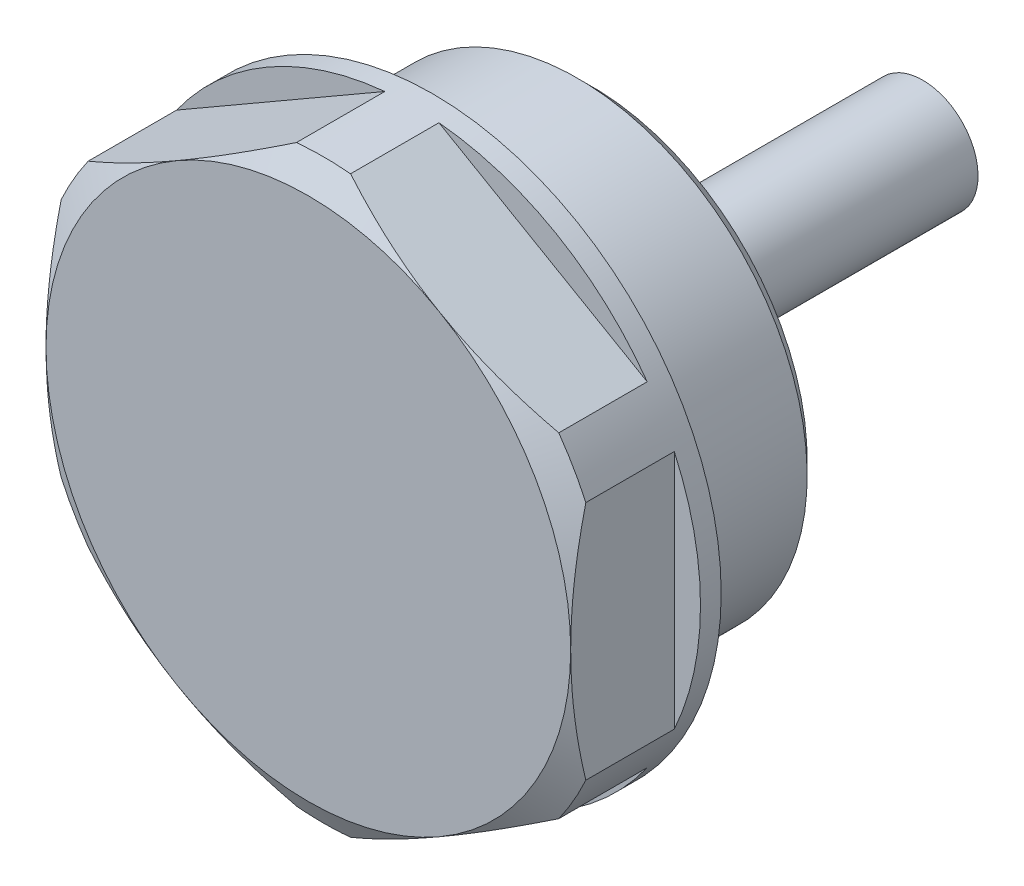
ISO-10303-21;
HEADER;
FILE_DESCRIPTION(('STEP AP214'),'2;1');
FILE_NAME('part.step','',(''),(''),'','','');
FILE_SCHEMA(('AUTOMOTIVE_DESIGN { 1 0 10303 214 1 1 1 1 }'));
ENDSEC;
DATA;
#1=APPLICATION_CONTEXT('core data for automotive mechanical design processes');
#2=APPLICATION_PROTOCOL_DEFINITION('international standard','automotive_design',2000,#1);
#3=PRODUCT_CONTEXT('',#1,'mechanical');
#4=PRODUCT('Part','Part','',(#3));
#5=PRODUCT_RELATED_PRODUCT_CATEGORY('part','',(#4));
#6=PRODUCT_DEFINITION_FORMATION('','',#4);
#7=PRODUCT_DEFINITION_CONTEXT('part definition',#1,'design');
#8=PRODUCT_DEFINITION('design','',#6,#7);
#9=PRODUCT_DEFINITION_SHAPE('','',#8);
#10=(LENGTH_UNIT() NAMED_UNIT(*) SI_UNIT(.MILLI.,.METRE.));
#11=(NAMED_UNIT(*) PLANE_ANGLE_UNIT() SI_UNIT($,.RADIAN.));
#12=(NAMED_UNIT(*) SI_UNIT($,.STERADIAN.) SOLID_ANGLE_UNIT());
#13=UNCERTAINTY_MEASURE_WITH_UNIT(LENGTH_MEASURE(1.E-05),#10,'distance_accuracy_value','');
#14=(GEOMETRIC_REPRESENTATION_CONTEXT(3) GLOBAL_UNCERTAINTY_ASSIGNED_CONTEXT((#13)) GLOBAL_UNIT_ASSIGNED_CONTEXT((#10,
#11,#12)) REPRESENTATION_CONTEXT('',''));
#15=CARTESIAN_POINT('',(0.,0.,0.));
#16=DIRECTION('',(0.,0.,1.));
#17=DIRECTION('',(1.,0.,0.));
#18=AXIS2_PLACEMENT_3D('',#15,#16,#17);
#19=CARTESIAN_POINT('',(0.,0.,9.5));
#20=DIRECTION('',(0.,0.,-1.));
#21=DIRECTION('',(0.,-1.,0.));
#22=AXIS2_PLACEMENT_3D('',#19,#20,#21);
#23=CONICAL_SURFACE('',#22,19.,1.0471975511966);
#24=CARTESIAN_POINT('',(0.,0.,8.40303448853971));
#25=DIRECTION('',(0.,0.,-1.));
#26=DIRECTION('',(0.,-1.,0.));
#27=AXIS2_PLACEMENT_3D('',#24,#25,#26);
#28=CIRCLE('',#27,20.9);
#29=CARTESIAN_POINT('',(-1.9596087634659,20.8079295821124,8.40303448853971));
#30=VERTEX_POINT('',#29);
#31=CARTESIAN_POINT('',(1.95960876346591,20.8079295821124,8.40303448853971));
#32=VERTEX_POINT('',#31);
#33=EDGE_CURVE('E188',#30,#32,#28,.T.);
#34=ORIENTED_EDGE('',*,*,#33,.F.);
#35=CARTESIAN_POINT('',(-1.9588886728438,20.8083453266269,8.40283448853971));
#36=CARTESIAN_POINT('',(-2.36142183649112,20.5759426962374,8.51465084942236));
#37=CARTESIAN_POINT('',(-2.76546131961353,20.3426703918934,8.61946734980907));
#38=CARTESIAN_POINT('',(-3.57644812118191,19.8744469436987,8.81355760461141));
#39=CARTESIAN_POINT('',(-3.98339626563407,19.639495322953,8.90282674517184));
#40=CARTESIAN_POINT('',(-4.80032360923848,19.1678421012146,9.06430340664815));
#41=CARTESIAN_POINT('',(-5.21030574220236,18.931138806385,9.1364913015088));
#42=CARTESIAN_POINT('',(-6.03237944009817,18.4565143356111,9.26222903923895));
#43=CARTESIAN_POINT('',(-6.44447079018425,18.2185932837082,9.31578074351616));
#44=CARTESIAN_POINT('',(-7.26217182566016,17.7464933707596,9.40222271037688));
#45=CARTESIAN_POINT('',(-7.66775095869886,17.512332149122,9.43549598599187));
#46=CARTESIAN_POINT('',(-8.47978498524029,17.0435040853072,9.4822434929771));
#47=CARTESIAN_POINT('',(-8.8862399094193,16.808837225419,9.49571701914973));
#48=CARTESIAN_POINT('',(-9.69896691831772,16.3396090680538,9.50254033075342));
#49=CARTESIAN_POINT('',(-10.1052389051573,16.1050478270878,9.49590549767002));
#50=CARTESIAN_POINT('',(-10.9171362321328,15.6362986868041,9.46270611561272));
#51=CARTESIAN_POINT('',(-11.3227616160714,15.402110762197,9.43614297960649));
#52=CARTESIAN_POINT('',(-12.1730086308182,14.9112204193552,9.36009347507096));
#53=CARTESIAN_POINT('',(-12.6174948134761,14.6545962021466,9.30858931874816));
#54=CARTESIAN_POINT('',(-13.504161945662,14.1426786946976,9.18356820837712));
#55=CARTESIAN_POINT('',(-13.9463426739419,13.8873855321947,9.11004917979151));
#56=CARTESIAN_POINT('',(-14.8326825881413,13.3756569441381,8.94181360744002));
#57=CARTESIAN_POINT('',(-15.2768092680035,13.1192402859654,8.84687086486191));
#58=CARTESIAN_POINT('',(-16.1615947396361,12.6084091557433,8.63833387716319));
#59=CARTESIAN_POINT('',(-16.6022548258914,12.3539939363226,8.52474697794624));
#60=CARTESIAN_POINT('',(-17.0411113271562,12.1006200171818,8.40283448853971));
#61=B_SPLINE_CURVE_WITH_KNOTS('',3,(#35,#36,#37,#38,#39,#40,#41,#42,#43,#44,#45,#46,#47,#48,#49,
#50,#51,#52,#53,#54,#55,#56,#57,#58,#59,#60),.UNSPECIFIED.,.F.,.F.,(4,2,2,2,2,2,2,2,2,2,2,2,4),
(0.,1.43422321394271,2.86887132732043,4.30515990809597,5.74130498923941,7.14940828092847,
8.55756172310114,9.96463829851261,11.3716151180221,12.9185787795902,14.4656882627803,
16.0299678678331,17.5936326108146),.UNSPECIFIED.);
#62=CARTESIAN_POINT('',(-9.5,16.4544826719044,9.5));
#63=VERTEX_POINT('',#62);
#64=EDGE_CURVE('E291',#30,#63,#61,.T.);
#65=ORIENTED_EDGE('',*,*,#64,.T.);
#66=CARTESIAN_POINT('',(0.,0.,9.5));
#67=DIRECTION('',(0.,0.,-1.));
#68=DIRECTION('',(0.,-1.,0.));
#69=AXIS2_PLACEMENT_3D('',#66,#67,#68);
#70=CIRCLE('',#69,19.);
#71=CARTESIAN_POINT('',(9.5,16.4544826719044,9.5));
#72=VERTEX_POINT('',#71);
#73=EDGE_CURVE('E170',#63,#72,#70,.T.);
#74=ORIENTED_EDGE('',*,*,#73,.T.);
#75=CARTESIAN_POINT('',(17.0411113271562,12.1006200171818,8.40283448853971));
#76=CARTESIAN_POINT('',(16.6385781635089,12.3330226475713,8.51465084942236));
#77=CARTESIAN_POINT('',(16.2345386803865,12.5662949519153,8.61946734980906));
#78=CARTESIAN_POINT('',(15.4235518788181,13.03451840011,8.8135576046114));
#79=CARTESIAN_POINT('',(15.0166037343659,13.2694700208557,8.90282674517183));
#80=CARTESIAN_POINT('',(14.1996763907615,13.7411232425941,9.06430340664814));
#81=CARTESIAN_POINT('',(13.7896942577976,13.9778265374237,9.13649130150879));
#82=CARTESIAN_POINT('',(12.9676205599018,14.4524510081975,9.26222903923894));
#83=CARTESIAN_POINT('',(12.5555292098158,14.6903720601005,9.31578074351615));
#84=CARTESIAN_POINT('',(11.7378281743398,15.1624719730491,9.40222271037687));
#85=CARTESIAN_POINT('',(11.3322490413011,15.3966331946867,9.43549598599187));
#86=CARTESIAN_POINT('',(10.5202150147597,15.8654612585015,9.4822434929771));
#87=CARTESIAN_POINT('',(10.1137600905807,16.1001281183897,9.49571701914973));
#88=CARTESIAN_POINT('',(9.30103308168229,16.5693562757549,9.50254033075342));
#89=CARTESIAN_POINT('',(8.89476109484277,16.8039175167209,9.49590549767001));
#90=CARTESIAN_POINT('',(8.0828637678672,17.2726666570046,9.46270611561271));
#91=CARTESIAN_POINT('',(7.67723838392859,17.5068545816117,9.43614297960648));
#92=CARTESIAN_POINT('',(6.82699136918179,17.9977449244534,9.36009347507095));
#93=CARTESIAN_POINT('',(6.38250518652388,18.254369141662,9.30858931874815));
#94=CARTESIAN_POINT('',(5.49583805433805,18.7662866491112,9.18356820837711));
#95=CARTESIAN_POINT('',(5.0536573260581,19.021579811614,9.1100491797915));
#96=CARTESIAN_POINT('',(4.16731741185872,19.5333083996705,8.94181360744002));
#97=CARTESIAN_POINT('',(3.72319073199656,19.7897250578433,8.8468708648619));
#98=CARTESIAN_POINT('',(2.83840526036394,20.3005561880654,8.63833387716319));
#99=CARTESIAN_POINT('',(2.39774517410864,20.554971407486,8.52474697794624));
#100=CARTESIAN_POINT('',(1.9588886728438,20.8083453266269,8.40283448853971));
#101=B_SPLINE_CURVE_WITH_KNOTS('',3,(#75,#76,#77,#78,#79,#80,#81,#82,#83,#84,#85,#86,#87,#88,
#89,#90,#91,#92,#93,#94,#95,#96,#97,#98,#99,#100),.UNSPECIFIED.,.F.,.F.,(4,2,2,2,2,2,2,2,2,2,2,
2,4),(0.,1.43422321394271,2.86887132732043,4.30515990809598,5.74130498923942,7.14940828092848,
8.55756172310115,9.96463829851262,11.3716151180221,12.9185787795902,14.4656882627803,
16.0299678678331,17.5936326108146),.UNSPECIFIED.);
#102=EDGE_CURVE('E193',#72,#32,#101,.T.);
#103=ORIENTED_EDGE('',*,*,#102,.T.);
#104=EDGE_LOOP('',(#34,#65,#74,#103));
#105=FACE_BOUND('',#104,.T.);
#106=ADVANCED_FACE('F14',(#105),#23,.T.);
#107=CARTESIAN_POINT('',(-9.5,-16.4544826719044,9.5));
#108=VERTEX_POINT('',#107);
#109=CARTESIAN_POINT('',(-19.,0.,9.5));
#110=VERTEX_POINT('',#109);
#111=EDGE_CURVE('E171',#108,#110,#70,.T.);
#112=ORIENTED_EDGE('',*,*,#111,.T.);
#113=CARTESIAN_POINT('',(-19.,-29.0099972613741,0.448167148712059));
#114=CARTESIAN_POINT('',(-19.,-28.5932310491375,0.649453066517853));
#115=CARTESIAN_POINT('',(-19.,-28.1759587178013,0.849690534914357));
#116=CARTESIAN_POINT('',(-19.,-27.3402948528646,1.24782772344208));
#117=CARTESIAN_POINT('',(-19.,-26.9219033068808,1.44572741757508));
#118=CARTESIAN_POINT('',(-19.,-25.664765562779,2.03561651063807));
#119=CARTESIAN_POINT('',(-19.,-24.8241931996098,2.4237295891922));
#120=CARTESIAN_POINT('',(-19.,-23.1323589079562,3.18933506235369));
#121=CARTESIAN_POINT('',(-19.,-22.281063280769,3.56675317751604));
#122=CARTESIAN_POINT('',(-19.,-20.5714451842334,4.30526464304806));
#123=CARTESIAN_POINT('',(-19.,-19.7131230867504,4.66635885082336));
#124=CARTESIAN_POINT('',(-19.,-17.9778201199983,5.37199593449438));
#125=CARTESIAN_POINT('',(-19.,-17.1007386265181,5.71629265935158));
#126=CARTESIAN_POINT('',(-19.,-15.3361947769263,6.37771380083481));
#127=CARTESIAN_POINT('',(-19.,-14.4487312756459,6.69483518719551));
#128=CARTESIAN_POINT('',(-19.,-12.663891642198,7.29331972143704));
#129=CARTESIAN_POINT('',(-19.,-11.7665414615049,7.57475962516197));
#130=CARTESIAN_POINT('',(-19.,-9.95900117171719,8.09270063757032));
#131=CARTESIAN_POINT('',(-19.,-9.04881524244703,8.32921602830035));
#132=CARTESIAN_POINT('',(-19.,-7.67373068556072,8.64160120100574));
#133=CARTESIAN_POINT('',(-19.,-7.21361889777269,8.73868386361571));
#134=CARTESIAN_POINT('',(-19.,-6.29034994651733,8.91717605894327));
#135=CARTESIAN_POINT('',(-19.,-5.82719285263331,8.99858594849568));
#136=CARTESIAN_POINT('',(-19.,-4.89815023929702,9.14428461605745));
#137=CARTESIAN_POINT('',(-19.,-4.43226455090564,9.20857232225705));
#138=CARTESIAN_POINT('',(-19.,-3.49830525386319,9.31873266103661));
#139=CARTESIAN_POINT('',(-19.,-3.03023164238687,9.36460526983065));
#140=CARTESIAN_POINT('',(-19.,-2.095502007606,9.43670492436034));
#141=CARTESIAN_POINT('',(-19.,-1.62885536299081,9.46305276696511));
#142=CARTESIAN_POINT('',(-19.,-0.694867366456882,9.49596562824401));
#143=CARTESIAN_POINT('',(-19.,-0.227526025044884,9.50253094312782));
#144=CARTESIAN_POINT('',(-19.,0.706885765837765,9.4957235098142));
#145=CARTESIAN_POINT('',(-19.,1.17395625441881,9.48235618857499));
#146=CARTESIAN_POINT('',(-19.,2.10712670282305,9.43601320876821));
#147=CARTESIAN_POINT('',(-19.,2.57322661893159,9.40303668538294));
#148=CARTESIAN_POINT('',(-19.,3.70524434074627,9.29981799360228));
#149=CARTESIAN_POINT('',(-19.,4.37026916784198,9.21962144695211));
#150=CARTESIAN_POINT('',(-19.,5.69508745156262,9.02379044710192));
#151=CARTESIAN_POINT('',(-19.,6.35488010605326,8.90815066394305));
#152=CARTESIAN_POINT('',(-19.,7.66958790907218,8.64536829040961));
#153=CARTESIAN_POINT('',(-19.,8.324489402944,8.49815802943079));
#154=CARTESIAN_POINT('',(-19.,9.62756096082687,8.1768017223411));
#155=CARTESIAN_POINT('',(-19.,10.2757312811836,8.00265670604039));
#156=CARTESIAN_POINT('',(-19.,11.5804886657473,7.62727333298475));
#157=CARTESIAN_POINT('',(-19.,12.2369203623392,7.4254985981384));
#158=CARTESIAN_POINT('',(-19.,13.5433530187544,7.00203754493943));
#159=CARTESIAN_POINT('',(-19.,14.1933533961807,6.78034944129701));
#160=CARTESIAN_POINT('',(-19.,15.483794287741,6.32173698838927));
#161=CARTESIAN_POINT('',(-19.,16.1242680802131,6.08490591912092));
#162=CARTESIAN_POINT('',(-19.,17.0809502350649,5.7194934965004));
#163=CARTESIAN_POINT('',(-19.,17.399122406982,5.59601556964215));
#164=CARTESIAN_POINT('',(-19.,18.0342314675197,5.34594718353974));
#165=CARTESIAN_POINT('',(-19.,18.3511683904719,5.21935681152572));
#166=CARTESIAN_POINT('',(-19.,18.6675329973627,5.0913501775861));
#167=B_SPLINE_CURVE_WITH_KNOTS('',3,(#113,#114,#115,#116,#117,#118,#119,#120,#121,#122,#123,
#124,#125,#126,#127,#128,#129,#130,#131,#132,#133,#134,#135,#136,#137,#138,#139,#140,#141,#142,
#143,#144,#145,#146,#147,#148,#149,#150,#151,#152,#153,#154,#155,#156,#157,#158,#159,#160,#161,
#162,#163,#164,#165,#166),.UNSPECIFIED.,.F.,.F.,(4,2,2,2,2,2,2,2,2,2,2,2,2,2,2,2,2,2,2,2,2,2,2,
2,2,2,4),(0.,1.38848236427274,2.77698015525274,5.55443218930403,8.34792422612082,
11.1412693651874,13.9676390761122,16.794323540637,19.6148203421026,22.4344189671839,
23.8449221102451,25.2553931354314,26.6659524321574,28.0765135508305,29.478273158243,
30.8800117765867,32.2813688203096,33.6827876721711,35.6911962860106,37.6999070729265,
39.7129673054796,41.7259505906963,43.785798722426,45.8458317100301,47.8942117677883,
48.9180750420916,49.9419096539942),.UNSPECIFIED.);
#168=CARTESIAN_POINT('',(-19.,-8.7068938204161,8.40303448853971));
#169=VERTEX_POINT('',#168);
#170=EDGE_CURVE('E278',#110,#169,#167,.F.);
#171=ORIENTED_EDGE('',*,*,#170,.T.);
#172=CARTESIAN_POINT('',(-17.0403912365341,-12.1010357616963,8.40303448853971));
#173=VERTEX_POINT('',#172);
#174=EDGE_CURVE('E347',#173,#169,#28,.T.);
#175=ORIENTED_EDGE('',*,*,#174,.F.);
#176=CARTESIAN_POINT('',(-17.0411113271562,-12.1006200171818,8.40283448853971));
#177=CARTESIAN_POINT('',(-16.6385781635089,-12.3330226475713,8.51465084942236));
#178=CARTESIAN_POINT('',(-16.2345386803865,-12.5662949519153,8.61946734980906));
#179=CARTESIAN_POINT('',(-15.4235518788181,-13.03451840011,8.8135576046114));
#180=CARTESIAN_POINT('',(-15.0166037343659,-13.2694700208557,8.90282674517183));
#181=CARTESIAN_POINT('',(-14.1996763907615,-13.7411232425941,9.06430340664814));
#182=CARTESIAN_POINT('',(-13.7896942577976,-13.9778265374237,9.13649130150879));
#183=CARTESIAN_POINT('',(-12.9676205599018,-14.4524510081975,9.26222903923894));
#184=CARTESIAN_POINT('',(-12.5555292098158,-14.6903720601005,9.31578074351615));
#185=CARTESIAN_POINT('',(-11.7378281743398,-15.1624719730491,9.40222271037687));
#186=CARTESIAN_POINT('',(-11.3322490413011,-15.3966331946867,9.43549598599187));
#187=CARTESIAN_POINT('',(-10.5202150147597,-15.8654612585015,9.4822434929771));
#188=CARTESIAN_POINT('',(-10.1137600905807,-16.1001281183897,9.49571701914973));
#189=CARTESIAN_POINT('',(-9.30103308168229,-16.5693562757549,9.50254033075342));
#190=CARTESIAN_POINT('',(-8.89476109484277,-16.8039175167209,9.49590549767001));
#191=CARTESIAN_POINT('',(-8.0828637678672,-17.2726666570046,9.46270611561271));
#192=CARTESIAN_POINT('',(-7.67723838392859,-17.5068545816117,9.43614297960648));
#193=CARTESIAN_POINT('',(-6.82699136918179,-17.9977449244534,9.36009347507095));
#194=CARTESIAN_POINT('',(-6.38250518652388,-18.254369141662,9.30858931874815));
#195=CARTESIAN_POINT('',(-5.49583805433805,-18.7662866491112,9.18356820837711));
#196=CARTESIAN_POINT('',(-5.0536573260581,-19.021579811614,9.1100491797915));
#197=CARTESIAN_POINT('',(-4.16731741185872,-19.5333083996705,8.94181360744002));
#198=CARTESIAN_POINT('',(-3.72319073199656,-19.7897250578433,8.8468708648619));
#199=CARTESIAN_POINT('',(-2.83840526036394,-20.3005561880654,8.63833387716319));
#200=CARTESIAN_POINT('',(-2.39774517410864,-20.554971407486,8.52474697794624));
#201=CARTESIAN_POINT('',(-1.9588886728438,-20.8083453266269,8.40283448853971));
#202=B_SPLINE_CURVE_WITH_KNOTS('',3,(#176,#177,#178,#179,#180,#181,#182,#183,#184,#185,#186,
#187,#188,#189,#190,#191,#192,#193,#194,#195,#196,#197,#198,#199,#200,#201),.UNSPECIFIED.,.F.,
.F.,(4,2,2,2,2,2,2,2,2,2,2,2,4),(0.,1.43422321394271,2.86887132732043,4.30515990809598,
5.74130498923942,7.14940828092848,8.55756172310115,9.96463829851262,11.3716151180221,
12.9185787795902,14.4656882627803,16.0299678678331,17.5936326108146),.UNSPECIFIED.);
#203=EDGE_CURVE('E279',#173,#108,#202,.T.);
#204=ORIENTED_EDGE('',*,*,#203,.T.);
#205=EDGE_LOOP('',(#112,#171,#175,#204));
#206=FACE_BOUND('',#205,.T.);
#207=ADVANCED_FACE('F262',(#206),#23,.T.);
#208=CARTESIAN_POINT('',(9.5,-16.4544826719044,9.5));
#209=VERTEX_POINT('',#208);
#210=EDGE_CURVE('E283',#209,#108,#70,.T.);
#211=ORIENTED_EDGE('',*,*,#210,.T.);
#212=CARTESIAN_POINT('',(-1.95960876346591,-20.8079295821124,8.40303448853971));
#213=VERTEX_POINT('',#212);
#214=EDGE_CURVE('E289',#108,#213,#202,.T.);
#215=ORIENTED_EDGE('',*,*,#214,.T.);
#216=CARTESIAN_POINT('',(1.9596087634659,-20.8079295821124,8.40303448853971));
#217=VERTEX_POINT('',#216);
#218=EDGE_CURVE('E346',#217,#213,#28,.T.);
#219=ORIENTED_EDGE('',*,*,#218,.F.);
#220=CARTESIAN_POINT('',(1.9588886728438,-20.8083453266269,8.40283448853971));
#221=CARTESIAN_POINT('',(2.36142183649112,-20.5759426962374,8.51465084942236));
#222=CARTESIAN_POINT('',(2.76546131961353,-20.3426703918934,8.61946734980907));
#223=CARTESIAN_POINT('',(3.57644812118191,-19.8744469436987,8.81355760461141));
#224=CARTESIAN_POINT('',(3.98339626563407,-19.639495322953,8.90282674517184));
#225=CARTESIAN_POINT('',(4.80032360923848,-19.1678421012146,9.06430340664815));
#226=CARTESIAN_POINT('',(5.21030574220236,-18.931138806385,9.1364913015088));
#227=CARTESIAN_POINT('',(6.03237944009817,-18.4565143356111,9.26222903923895));
#228=CARTESIAN_POINT('',(6.44447079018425,-18.2185932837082,9.31578074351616));
#229=CARTESIAN_POINT('',(7.26217182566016,-17.7464933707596,9.40222271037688));
#230=CARTESIAN_POINT('',(7.66775095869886,-17.512332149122,9.43549598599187));
#231=CARTESIAN_POINT('',(8.47978498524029,-17.0435040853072,9.4822434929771));
#232=CARTESIAN_POINT('',(8.8862399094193,-16.808837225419,9.49571701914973));
#233=CARTESIAN_POINT('',(9.69896691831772,-16.3396090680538,9.50254033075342));
#234=CARTESIAN_POINT('',(10.1052389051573,-16.1050478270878,9.49590549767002));
#235=CARTESIAN_POINT('',(10.9171362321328,-15.6362986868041,9.46270611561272));
#236=CARTESIAN_POINT('',(11.3227616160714,-15.402110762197,9.43614297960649));
#237=CARTESIAN_POINT('',(12.1730086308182,-14.9112204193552,9.36009347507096));
#238=CARTESIAN_POINT('',(12.6174948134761,-14.6545962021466,9.30858931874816));
#239=CARTESIAN_POINT('',(13.504161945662,-14.1426786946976,9.18356820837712));
#240=CARTESIAN_POINT('',(13.9463426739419,-13.8873855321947,9.11004917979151));
#241=CARTESIAN_POINT('',(14.8326825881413,-13.3756569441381,8.94181360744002));
#242=CARTESIAN_POINT('',(15.2768092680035,-13.1192402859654,8.84687086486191));
#243=CARTESIAN_POINT('',(16.1615947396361,-12.6084091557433,8.63833387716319));
#244=CARTESIAN_POINT('',(16.6022548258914,-12.3539939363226,8.52474697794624));
#245=CARTESIAN_POINT('',(17.0411113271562,-12.1006200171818,8.40283448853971));
#246=B_SPLINE_CURVE_WITH_KNOTS('',3,(#220,#221,#222,#223,#224,#225,#226,#227,#228,#229,#230,
#231,#232,#233,#234,#235,#236,#237,#238,#239,#240,#241,#242,#243,#244,#245),.UNSPECIFIED.,.F.,
.F.,(4,2,2,2,2,2,2,2,2,2,2,2,4),(0.,1.43422321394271,2.86887132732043,4.30515990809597,
5.74130498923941,7.14940828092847,8.55756172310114,9.96463829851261,11.3716151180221,
12.9185787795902,14.4656882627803,16.0299678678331,17.5936326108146),.UNSPECIFIED.);
#247=EDGE_CURVE('E327',#217,#209,#246,.T.);
#248=ORIENTED_EDGE('',*,*,#247,.T.);
#249=EDGE_LOOP('',(#211,#215,#219,#248));
#250=FACE_BOUND('',#249,.T.);
#251=ADVANCED_FACE('F266',(#250),#23,.T.);
#252=CARTESIAN_POINT('',(19.,0.,9.5));
#253=VERTEX_POINT('',#252);
#254=EDGE_CURVE('E459',#253,#209,#70,.T.);
#255=ORIENTED_EDGE('',*,*,#254,.T.);
#256=CARTESIAN_POINT('',(17.0403912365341,-12.1010357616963,8.40303448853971));
#257=VERTEX_POINT('',#256);
#258=EDGE_CURVE('E333',#209,#257,#246,.T.);
#259=ORIENTED_EDGE('',*,*,#258,.T.);
#260=CARTESIAN_POINT('',(19.,-8.7068938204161,8.40303448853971));
#261=VERTEX_POINT('',#260);
#262=EDGE_CURVE('E343',#261,#257,#28,.T.);
#263=ORIENTED_EDGE('',*,*,#262,.F.);
#264=CARTESIAN_POINT('',(19.,-29.0099972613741,0.44816714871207));
#265=CARTESIAN_POINT('',(19.,-28.5932310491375,0.649453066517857));
#266=CARTESIAN_POINT('',(19.,-28.1759587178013,0.849690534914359));
#267=CARTESIAN_POINT('',(19.,-27.3402948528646,1.24782772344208));
#268=CARTESIAN_POINT('',(19.,-26.9219033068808,1.44572741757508));
#269=CARTESIAN_POINT('',(19.,-25.6647655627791,2.03561651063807));
#270=CARTESIAN_POINT('',(19.,-24.8241931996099,2.4237295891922));
#271=CARTESIAN_POINT('',(19.,-23.1323589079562,3.18933506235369));
#272=CARTESIAN_POINT('',(19.,-22.281063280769,3.56675317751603));
#273=CARTESIAN_POINT('',(19.,-20.5714451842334,4.30526464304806));
#274=CARTESIAN_POINT('',(19.,-19.7131230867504,4.66635885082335));
#275=CARTESIAN_POINT('',(19.,-17.9778201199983,5.37199593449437));
#276=CARTESIAN_POINT('',(19.,-17.1007386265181,5.71629265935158));
#277=CARTESIAN_POINT('',(19.,-15.3361947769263,6.37771380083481));
#278=CARTESIAN_POINT('',(19.,-14.4487312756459,6.69483518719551));
#279=CARTESIAN_POINT('',(19.,-12.663891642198,7.29331972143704));
#280=CARTESIAN_POINT('',(19.,-11.7665414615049,7.57475962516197));
#281=CARTESIAN_POINT('',(19.,-9.95900117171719,8.09270063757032));
#282=CARTESIAN_POINT('',(19.,-9.04881524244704,8.32921602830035));
#283=CARTESIAN_POINT('',(19.,-7.67373068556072,8.64160120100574));
#284=CARTESIAN_POINT('',(19.,-7.21361889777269,8.73868386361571));
#285=CARTESIAN_POINT('',(19.,-6.29034994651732,8.91717605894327));
#286=CARTESIAN_POINT('',(19.,-5.82719285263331,8.99858594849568));
#287=CARTESIAN_POINT('',(19.,-4.89815023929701,9.14428461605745));
#288=CARTESIAN_POINT('',(19.,-4.43226455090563,9.20857232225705));
#289=CARTESIAN_POINT('',(19.,-3.49830525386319,9.31873266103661));
#290=CARTESIAN_POINT('',(19.,-3.03023164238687,9.36460526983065));
#291=CARTESIAN_POINT('',(19.,-2.095502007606,9.43670492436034));
#292=CARTESIAN_POINT('',(19.,-1.62885536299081,9.46305276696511));
#293=CARTESIAN_POINT('',(19.,-0.694867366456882,9.49596562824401));
#294=CARTESIAN_POINT('',(19.,-0.227526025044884,9.50253094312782));
#295=CARTESIAN_POINT('',(19.,0.706885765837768,9.4957235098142));
#296=CARTESIAN_POINT('',(19.,1.17395625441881,9.48235618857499));
#297=CARTESIAN_POINT('',(19.,2.10712670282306,9.43601320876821));
#298=CARTESIAN_POINT('',(19.,2.5732266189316,9.40303668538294));
#299=CARTESIAN_POINT('',(19.,3.70524434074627,9.29981799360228));
#300=CARTESIAN_POINT('',(19.,4.37026916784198,9.21962144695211));
#301=CARTESIAN_POINT('',(19.,5.69508745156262,9.02379044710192));
#302=CARTESIAN_POINT('',(19.,6.35488010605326,8.90815066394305));
#303=CARTESIAN_POINT('',(19.,7.66958790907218,8.6453682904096));
#304=CARTESIAN_POINT('',(19.,8.324489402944,8.49815802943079));
#305=CARTESIAN_POINT('',(19.,9.62756096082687,8.1768017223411));
#306=CARTESIAN_POINT('',(19.,10.2757312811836,8.0026567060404));
#307=CARTESIAN_POINT('',(19.,11.5804886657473,7.62727333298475));
#308=CARTESIAN_POINT('',(19.,12.2369203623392,7.4254985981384));
#309=CARTESIAN_POINT('',(19.,13.5433530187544,7.00203754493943));
#310=CARTESIAN_POINT('',(19.,14.1933533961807,6.78034944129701));
#311=CARTESIAN_POINT('',(19.,15.483794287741,6.32173698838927));
#312=CARTESIAN_POINT('',(19.,16.1242680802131,6.08490591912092));
#313=CARTESIAN_POINT('',(19.,17.0809502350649,5.7194934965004));
#314=CARTESIAN_POINT('',(19.,17.399122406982,5.59601556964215));
#315=CARTESIAN_POINT('',(19.,18.0342314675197,5.34594718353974));
#316=CARTESIAN_POINT('',(19.,18.3511683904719,5.21935681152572));
#317=CARTESIAN_POINT('',(19.,18.6675329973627,5.0913501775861));
#318=B_SPLINE_CURVE_WITH_KNOTS('',3,(#264,#265,#266,#267,#268,#269,#270,#271,#272,#273,#274,
#275,#276,#277,#278,#279,#280,#281,#282,#283,#284,#285,#286,#287,#288,#289,#290,#291,#292,#293,
#294,#295,#296,#297,#298,#299,#300,#301,#302,#303,#304,#305,#306,#307,#308,#309,#310,#311,#312,
#313,#314,#315,#316,#317),.UNSPECIFIED.,.F.,.F.,(4,2,2,2,2,2,2,2,2,2,2,2,2,2,2,2,2,2,2,2,2,2,2,
2,2,2,4),(0.,1.38848236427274,2.77698015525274,5.55443218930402,8.34792422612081,
11.1412693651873,13.9676390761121,16.794323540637,19.6148203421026,22.4344189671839,
23.8449221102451,25.2553931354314,26.6659524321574,28.0765135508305,29.478273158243,
30.8800117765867,32.2813688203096,33.6827876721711,35.6911962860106,37.6999070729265,
39.7129673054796,41.7259505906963,43.785798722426,45.8458317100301,47.8942117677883,
48.9180750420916,49.9419096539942),.UNSPECIFIED.);
#319=EDGE_CURVE('E201',#261,#253,#318,.T.);
#320=ORIENTED_EDGE('',*,*,#319,.T.);
#321=EDGE_LOOP('',(#255,#259,#263,#320));
#322=FACE_BOUND('',#321,.T.);
#323=ADVANCED_FACE('F271',(#322),#23,.T.);
#324=EDGE_CURVE('E341',#72,#253,#70,.T.);
#325=ORIENTED_EDGE('',*,*,#324,.T.);
#326=CARTESIAN_POINT('',(19.,8.7068938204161,8.40303448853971));
#327=VERTEX_POINT('',#326);
#328=EDGE_CURVE('E204',#253,#327,#318,.T.);
#329=ORIENTED_EDGE('',*,*,#328,.T.);
#330=CARTESIAN_POINT('',(17.0403912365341,12.1010357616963,8.40303448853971));
#331=VERTEX_POINT('',#330);
#332=EDGE_CURVE('E340',#331,#327,#28,.T.);
#333=ORIENTED_EDGE('',*,*,#332,.F.);
#334=EDGE_CURVE('E137',#331,#72,#101,.T.);
#335=ORIENTED_EDGE('',*,*,#334,.T.);
#336=EDGE_LOOP('',(#325,#329,#333,#335));
#337=FACE_BOUND('',#336,.T.);
#338=ADVANCED_FACE('F259',(#337),#23,.T.);
#339=CARTESIAN_POINT('',(0.,0.,9.5));
#340=DIRECTION('',(0.,0.,-1.));
#341=DIRECTION('',(0.,-1.,0.));
#342=AXIS2_PLACEMENT_3D('',#339,#340,#341);
#343=PLANE('',#342);
#344=EDGE_CURVE('E164',#110,#63,#70,.T.);
#345=ORIENTED_EDGE('',*,*,#344,.F.);
#346=ORIENTED_EDGE('',*,*,#111,.F.);
#347=ORIENTED_EDGE('',*,*,#210,.F.);
#348=ORIENTED_EDGE('',*,*,#254,.F.);
#349=ORIENTED_EDGE('',*,*,#324,.F.);
#350=ORIENTED_EDGE('',*,*,#73,.F.);
#351=EDGE_LOOP('',(#345,#346,#347,#348,#349,#350));
#352=FACE_BOUND('',#351,.T.);
#353=ADVANCED_FACE('F16',(#352),#343,.F.);
#354=ORIENTED_EDGE('',*,*,#344,.T.);
#355=CARTESIAN_POINT('',(-17.0403912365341,12.1010357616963,8.40303448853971));
#356=VERTEX_POINT('',#355);
#357=EDGE_CURVE('E286',#63,#356,#61,.T.);
#358=ORIENTED_EDGE('',*,*,#357,.T.);
#359=CARTESIAN_POINT('',(-19.,8.7068938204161,8.40303448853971));
#360=VERTEX_POINT('',#359);
#361=EDGE_CURVE('E144',#360,#356,#28,.T.);
#362=ORIENTED_EDGE('',*,*,#361,.F.);
#363=EDGE_CURVE('E287',#360,#110,#167,.F.);
#364=ORIENTED_EDGE('',*,*,#363,.T.);
#365=EDGE_LOOP('',(#354,#358,#362,#364));
#366=FACE_BOUND('',#365,.T.);
#367=ADVANCED_FACE('F218',(#366),#23,.T.);
#368=CARTESIAN_POINT('',(0.,0.,-35.));
#369=DIRECTION('',(0.,0.,-1.));
#370=DIRECTION('',(0.,-1.,0.));
#371=AXIS2_PLACEMENT_3D('',#368,#369,#370);
#372=CYLINDRICAL_SURFACE('',#371,20.9);
#373=CARTESIAN_POINT('',(0.,0.,0.5));
#374=DIRECTION('',(0.,0.,-1.));
#375=DIRECTION('',(0.,-1.,0.));
#376=AXIS2_PLACEMENT_3D('',#373,#374,#375);
#377=CIRCLE('',#376,20.9);
#378=CARTESIAN_POINT('',(0.,-20.9,0.5));
#379=VERTEX_POINT('',#378);
#380=EDGE_CURVE('E349',#379,#379,#377,.T.);
#381=ORIENTED_EDGE('',*,*,#380,.F.);
#382=EDGE_LOOP('',(#381));
#383=FACE_BOUND('',#382,.T.);
#384=ORIENTED_EDGE('',*,*,#218,.T.);
#385=DIRECTION('',(0.,0.,-1.));
#386=VECTOR('',#385,1.);
#387=CARTESIAN_POINT('',(-1.95960876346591,-20.8079295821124,-35.));
#388=LINE('',#387,#386);
#389=CARTESIAN_POINT('',(-1.95960876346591,-20.8079295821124,2.));
#390=VERTEX_POINT('',#389);
#391=EDGE_CURVE('E9',#213,#390,#388,.T.);
#392=ORIENTED_EDGE('',*,*,#391,.T.);
#393=CARTESIAN_POINT('',(0.,0.,2.));
#394=DIRECTION('',(0.,0.,-1.));
#395=DIRECTION('',(0.,-1.,0.));
#396=AXIS2_PLACEMENT_3D('',#393,#394,#395);
#397=CIRCLE('',#396,20.9);
#398=CARTESIAN_POINT('',(-17.0403912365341,-12.1010357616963,2.));
#399=VERTEX_POINT('',#398);
#400=EDGE_CURVE('E148',#390,#399,#397,.T.);
#401=ORIENTED_EDGE('',*,*,#400,.T.);
#402=DIRECTION('',(0.,0.,-1.));
#403=VECTOR('',#402,1.);
#404=CARTESIAN_POINT('',(-17.0403912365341,-12.1010357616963,-35.));
#405=LINE('',#404,#403);
#406=EDGE_CURVE('E22',#399,#173,#405,.F.);
#407=ORIENTED_EDGE('',*,*,#406,.T.);
#408=ORIENTED_EDGE('',*,*,#174,.T.);
#409=DIRECTION('',(0.,0.,-1.));
#410=VECTOR('',#409,1.);
#411=CARTESIAN_POINT('',(-19.,-8.7068938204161,-35.));
#412=LINE('',#411,#410);
#413=CARTESIAN_POINT('',(-19.,-8.7068938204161,2.));
#414=VERTEX_POINT('',#413);
#415=EDGE_CURVE('E153',#169,#414,#412,.T.);
#416=ORIENTED_EDGE('',*,*,#415,.T.);
#417=CARTESIAN_POINT('',(-19.,8.7068938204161,2.));
#418=VERTEX_POINT('',#417);
#419=EDGE_CURVE('E132',#414,#418,#397,.T.);
#420=ORIENTED_EDGE('',*,*,#419,.T.);
#421=DIRECTION('',(0.,0.,-1.));
#422=VECTOR('',#421,1.);
#423=CARTESIAN_POINT('',(-19.,8.7068938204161,-35.));
#424=LINE('',#423,#422);
#425=EDGE_CURVE('E147',#418,#360,#424,.F.);
#426=ORIENTED_EDGE('',*,*,#425,.T.);
#427=ORIENTED_EDGE('',*,*,#361,.T.);
#428=DIRECTION('',(0.,0.,-1.));
#429=VECTOR('',#428,1.);
#430=CARTESIAN_POINT('',(-17.0403912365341,12.1010357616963,-35.));
#431=LINE('',#430,#429);
#432=CARTESIAN_POINT('',(-17.0403912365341,12.1010357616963,2.));
#433=VERTEX_POINT('',#432);
#434=EDGE_CURVE('E135',#356,#433,#431,.T.);
#435=ORIENTED_EDGE('',*,*,#434,.T.);
#436=CARTESIAN_POINT('',(-1.9596087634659,20.8079295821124,2.));
#437=VERTEX_POINT('',#436);
#438=EDGE_CURVE('E120',#433,#437,#397,.T.);
#439=ORIENTED_EDGE('',*,*,#438,.T.);
#440=DIRECTION('',(0.,0.,-1.));
#441=VECTOR('',#440,1.);
#442=CARTESIAN_POINT('',(-1.9596087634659,20.8079295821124,-35.));
#443=LINE('',#442,#441);
#444=EDGE_CURVE('E128',#437,#30,#443,.F.);
#445=ORIENTED_EDGE('',*,*,#444,.T.);
#446=ORIENTED_EDGE('',*,*,#33,.T.);
#447=DIRECTION('',(0.,0.,-1.));
#448=VECTOR('',#447,1.);
#449=CARTESIAN_POINT('',(1.95960876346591,20.8079295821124,-35.));
#450=LINE('',#449,#448);
#451=CARTESIAN_POINT('',(1.95960876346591,20.8079295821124,2.));
#452=VERTEX_POINT('',#451);
#453=EDGE_CURVE('E129',#32,#452,#450,.T.);
#454=ORIENTED_EDGE('',*,*,#453,.T.);
#455=CARTESIAN_POINT('',(17.0403912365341,12.1010357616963,2.));
#456=VERTEX_POINT('',#455);
#457=EDGE_CURVE('E131',#452,#456,#397,.T.);
#458=ORIENTED_EDGE('',*,*,#457,.T.);
#459=DIRECTION('',(0.,0.,-1.));
#460=VECTOR('',#459,1.);
#461=CARTESIAN_POINT('',(17.0403912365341,12.1010357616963,-35.));
#462=LINE('',#461,#460);
#463=EDGE_CURVE('E180',#456,#331,#462,.F.);
#464=ORIENTED_EDGE('',*,*,#463,.T.);
#465=ORIENTED_EDGE('',*,*,#332,.T.);
#466=DIRECTION('',(0.,0.,-1.));
#467=VECTOR('',#466,1.);
#468=CARTESIAN_POINT('',(19.,8.7068938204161,-35.));
#469=LINE('',#468,#467);
#470=CARTESIAN_POINT('',(19.,8.7068938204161,2.));
#471=VERTEX_POINT('',#470);
#472=EDGE_CURVE('E176',#327,#471,#469,.T.);
#473=ORIENTED_EDGE('',*,*,#472,.T.);
#474=CARTESIAN_POINT('',(19.,-8.7068938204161,2.));
#475=VERTEX_POINT('',#474);
#476=EDGE_CURVE('E165',#471,#475,#397,.T.);
#477=ORIENTED_EDGE('',*,*,#476,.T.);
#478=DIRECTION('',(0.,0.,-1.));
#479=VECTOR('',#478,1.);
#480=CARTESIAN_POINT('',(19.,-8.7068938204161,-35.));
#481=LINE('',#480,#479);
#482=EDGE_CURVE('E173',#475,#261,#481,.F.);
#483=ORIENTED_EDGE('',*,*,#482,.T.);
#484=ORIENTED_EDGE('',*,*,#262,.T.);
#485=DIRECTION('',(0.,0.,-1.));
#486=VECTOR('',#485,1.);
#487=CARTESIAN_POINT('',(17.0403912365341,-12.1010357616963,-35.));
#488=LINE('',#487,#486);
#489=CARTESIAN_POINT('',(17.0403912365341,-12.1010357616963,2.));
#490=VERTEX_POINT('',#489);
#491=EDGE_CURVE('E168',#257,#490,#488,.T.);
#492=ORIENTED_EDGE('',*,*,#491,.T.);
#493=CARTESIAN_POINT('',(1.9596087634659,-20.8079295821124,2.));
#494=VERTEX_POINT('',#493);
#495=EDGE_CURVE('E159',#490,#494,#397,.T.);
#496=ORIENTED_EDGE('',*,*,#495,.T.);
#497=DIRECTION('',(0.,0.,-1.));
#498=VECTOR('',#497,1.);
#499=CARTESIAN_POINT('',(1.9596087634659,-20.8079295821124,-35.));
#500=LINE('',#499,#498);
#501=EDGE_CURVE('E163',#494,#217,#500,.F.);
#502=ORIENTED_EDGE('',*,*,#501,.T.);
#503=EDGE_LOOP('',(#384,#392,#401,#407,#408,#416,#420,#426,#427,#435,#439,#445,#446,#454,#458,
#464,#465,#473,#477,#483,#484,#492,#496,#502));
#504=FACE_BOUND('',#503,.T.);
#505=ADVANCED_FACE('F141',(#383,#504),#372,.T.);
#506=CARTESIAN_POINT('',(-20.9,0.,0.5));
#507=DIRECTION('',(0.,0.,1.));
#508=DIRECTION('',(0.,1.,0.));
#509=AXIS2_PLACEMENT_3D('',#506,#507,#508);
#510=PLANE('',#509);
#511=CARTESIAN_POINT('',(0.,0.,0.5));
#512=DIRECTION('',(0.,0.,-1.));
#513=DIRECTION('',(0.,-1.,0.));
#514=AXIS2_PLACEMENT_3D('',#511,#512,#513);
#515=CIRCLE('',#514,17.8911666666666);
#516=CARTESIAN_POINT('',(0.,-17.8911666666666,0.5));
#517=VERTEX_POINT('',#516);
#518=EDGE_CURVE('E352',#517,#517,#515,.T.);
#519=ORIENTED_EDGE('',*,*,#518,.F.);
#520=EDGE_LOOP('',(#519));
#521=FACE_BOUND('',#520,.T.);
#522=ORIENTED_EDGE('',*,*,#380,.T.);
#523=EDGE_LOOP('',(#522));
#524=FACE_BOUND('',#523,.T.);
#525=ADVANCED_FACE('F248',(#521,#524),#510,.F.);
#526=CARTESIAN_POINT('',(0.,0.,-35.));
#527=DIRECTION('',(0.,0.,-1.));
#528=DIRECTION('',(0.,-1.,0.));
#529=AXIS2_PLACEMENT_3D('',#526,#527,#528);
#530=CYLINDRICAL_SURFACE('',#529,17.8911666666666);
#531=CARTESIAN_POINT('',(0.,0.,0.));
#532=DIRECTION('',(0.,0.,-1.));
#533=DIRECTION('',(0.,-1.,0.));
#534=AXIS2_PLACEMENT_3D('',#531,#532,#533);
#535=CIRCLE('',#534,17.8911666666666);
#536=CARTESIAN_POINT('',(0.,-17.8911666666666,0.));
#537=VERTEX_POINT('',#536);
#538=EDGE_CURVE('E355',#537,#537,#535,.T.);
#539=ORIENTED_EDGE('',*,*,#538,.F.);
#540=EDGE_LOOP('',(#539));
#541=FACE_BOUND('',#540,.T.);
#542=ORIENTED_EDGE('',*,*,#518,.T.);
#543=EDGE_LOOP('',(#542));
#544=FACE_BOUND('',#543,.T.);
#545=ADVANCED_FACE('F244',(#541,#544),#530,.T.);
#546=CARTESIAN_POINT('',(-17.8911666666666,0.,0.));
#547=DIRECTION('',(0.,0.,1.));
#548=DIRECTION('',(0.,1.,0.));
#549=AXIS2_PLACEMENT_3D('',#546,#547,#548);
#550=PLANE('',#549);
#551=CARTESIAN_POINT('',(0.,0.,0.));
#552=DIRECTION('',(0.,0.,-1.));
#553=DIRECTION('',(0.,-1.,0.));
#554=AXIS2_PLACEMENT_3D('',#551,#552,#553);
#555=CIRCLE('',#554,16.6245);
#556=CARTESIAN_POINT('',(0.,-16.6245,0.));
#557=VERTEX_POINT('',#556);
#558=EDGE_CURVE('E358',#557,#557,#555,.T.);
#559=ORIENTED_EDGE('',*,*,#558,.F.);
#560=EDGE_LOOP('',(#559));
#561=FACE_BOUND('',#560,.T.);
#562=ORIENTED_EDGE('',*,*,#538,.T.);
#563=EDGE_LOOP('',(#562));
#564=FACE_BOUND('',#563,.T.);
#565=ADVANCED_FACE('F240',(#561,#564),#550,.F.);
#566=CARTESIAN_POINT('',(0.,0.,-35.));
#567=DIRECTION('',(0.,0.,-1.));
#568=DIRECTION('',(0.,-1.,0.));
#569=AXIS2_PLACEMENT_3D('',#566,#567,#568);
#570=CYLINDRICAL_SURFACE('',#569,16.6245);
#571=CARTESIAN_POINT('',(0.,0.,0.5));
#572=DIRECTION('',(0.,0.,-1.));
#573=DIRECTION('',(0.,-1.,0.));
#574=AXIS2_PLACEMENT_3D('',#571,#572,#573);
#575=CIRCLE('',#574,16.6245);
#576=CARTESIAN_POINT('',(0.,-16.6245,0.5));
#577=VERTEX_POINT('',#576);
#578=EDGE_CURVE('E361',#577,#577,#575,.T.);
#579=ORIENTED_EDGE('',*,*,#578,.F.);
#580=EDGE_LOOP('',(#579));
#581=FACE_BOUND('',#580,.T.);
#582=ORIENTED_EDGE('',*,*,#558,.T.);
#583=EDGE_LOOP('',(#582));
#584=FACE_BOUND('',#583,.T.);
#585=ADVANCED_FACE('F236',(#581,#584),#570,.F.);
#586=CARTESIAN_POINT('',(-16.6245,0.,0.5));
#587=DIRECTION('',(0.,0.,1.));
#588=DIRECTION('',(0.,1.,0.));
#589=AXIS2_PLACEMENT_3D('',#586,#587,#588);
#590=PLANE('',#589);
#591=CARTESIAN_POINT('',(0.,0.,0.5));
#592=DIRECTION('',(0.,0.,-1.));
#593=DIRECTION('',(0.,-1.,0.));
#594=AXIS2_PLACEMENT_3D('',#591,#592,#593);
#595=CIRCLE('',#594,13.2996);
#596=CARTESIAN_POINT('',(0.,-13.2996,0.5));
#597=VERTEX_POINT('',#596);
#598=EDGE_CURVE('E364',#597,#597,#595,.T.);
#599=ORIENTED_EDGE('',*,*,#598,.F.);
#600=EDGE_LOOP('',(#599));
#601=FACE_BOUND('',#600,.T.);
#602=ORIENTED_EDGE('',*,*,#578,.T.);
#603=EDGE_LOOP('',(#602));
#604=FACE_BOUND('',#603,.T.);
#605=ADVANCED_FACE('F232',(#601,#604),#590,.F.);
#606=CARTESIAN_POINT('',(0.,0.,-35.));
#607=DIRECTION('',(0.,0.,-1.));
#608=DIRECTION('',(0.,-1.,0.));
#609=AXIS2_PLACEMENT_3D('',#606,#607,#608);
#610=CYLINDRICAL_SURFACE('',#609,13.2996);
#611=CARTESIAN_POINT('',(0.,0.,-0.5));
#612=DIRECTION('',(0.,0.,-1.));
#613=DIRECTION('',(0.,-1.,0.));
#614=AXIS2_PLACEMENT_3D('',#611,#612,#613);
#615=CIRCLE('',#614,13.2996);
#616=CARTESIAN_POINT('',(0.,-13.2996,-0.5));
#617=VERTEX_POINT('',#616);
#618=EDGE_CURVE('E366',#617,#617,#615,.T.);
#619=ORIENTED_EDGE('',*,*,#618,.F.);
#620=EDGE_LOOP('',(#619));
#621=FACE_BOUND('',#620,.T.);
#622=ORIENTED_EDGE('',*,*,#598,.T.);
#623=EDGE_LOOP('',(#622));
#624=FACE_BOUND('',#623,.T.);
#625=ADVANCED_FACE('F228',(#621,#624),#610,.T.);
#626=CARTESIAN_POINT('',(0.,0.,2.));
#627=DIRECTION('',(0.,0.,-1.));
#628=DIRECTION('',(0.,-1.,0.));
#629=AXIS2_PLACEMENT_3D('',#626,#627,#628);
#630=PLANE('',#629);
#631=DIRECTION('',(-0.866025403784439,-0.5,0.));
#632=VECTOR('',#631,1.);
#633=CARTESIAN_POINT('',(19.,-10.9696551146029,2.));
#634=LINE('',#633,#632);
#635=EDGE_CURVE('E452',#490,#494,#634,.T.);
#636=ORIENTED_EDGE('',*,*,#635,.T.);
#637=ORIENTED_EDGE('',*,*,#495,.F.);
#638=EDGE_LOOP('',(#636,#637));
#639=FACE_BOUND('',#638,.T.);
#640=ADVANCED_FACE('F231',(#639),#630,.F.);
#641=CARTESIAN_POINT('',(19.,-10.9696551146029,2.));
#642=DIRECTION('',(-0.5,0.866025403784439,0.));
#643=DIRECTION('',(0.866025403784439,0.5,0.));
#644=AXIS2_PLACEMENT_3D('',#641,#642,#643);
#645=PLANE('',#644);
#646=ORIENTED_EDGE('',*,*,#258,.F.);
#647=ORIENTED_EDGE('',*,*,#247,.F.);
#648=ORIENTED_EDGE('',*,*,#501,.F.);
#649=ORIENTED_EDGE('',*,*,#635,.F.);
#650=ORIENTED_EDGE('',*,*,#491,.F.);
#651=EDGE_LOOP('',(#646,#647,#648,#649,#650));
#652=FACE_BOUND('',#651,.T.);
#653=ADVANCED_FACE('F322',(#652),#645,.F.);
#654=DIRECTION('',(0.,-1.,0.));
#655=VECTOR('',#654,1.);
#656=CARTESIAN_POINT('',(19.,10.9696551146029,2.));
#657=LINE('',#656,#655);
#658=EDGE_CURVE('E450',#471,#475,#657,.T.);
#659=ORIENTED_EDGE('',*,*,#658,.T.);
#660=ORIENTED_EDGE('',*,*,#476,.F.);
#661=EDGE_LOOP('',(#659,#660));
#662=FACE_BOUND('',#661,.T.);
#663=ADVANCED_FACE('F325',(#662),#630,.F.);
#664=CARTESIAN_POINT('',(19.,10.9696551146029,2.));
#665=DIRECTION('',(-1.,0.,0.));
#666=DIRECTION('',(0.,1.,0.));
#667=AXIS2_PLACEMENT_3D('',#664,#665,#666);
#668=PLANE('',#667);
#669=ORIENTED_EDGE('',*,*,#328,.F.);
#670=ORIENTED_EDGE('',*,*,#319,.F.);
#671=ORIENTED_EDGE('',*,*,#482,.F.);
#672=ORIENTED_EDGE('',*,*,#658,.F.);
#673=ORIENTED_EDGE('',*,*,#472,.F.);
#674=EDGE_LOOP('',(#669,#670,#671,#672,#673));
#675=FACE_BOUND('',#674,.T.);
#676=ADVANCED_FACE('F225',(#675),#668,.F.);
#677=DIRECTION('',(0.866025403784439,-0.5,0.));
#678=VECTOR('',#677,1.);
#679=CARTESIAN_POINT('',(0.,21.9393102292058,2.));
#680=LINE('',#679,#678);
#681=EDGE_CURVE('E196',#452,#456,#680,.T.);
#682=ORIENTED_EDGE('',*,*,#681,.T.);
#683=ORIENTED_EDGE('',*,*,#457,.F.);
#684=EDGE_LOOP('',(#682,#683));
#685=FACE_BOUND('',#684,.T.);
#686=ADVANCED_FACE('F224',(#685),#630,.F.);
#687=CARTESIAN_POINT('',(0.,21.9393102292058,2.));
#688=DIRECTION('',(-0.5,-0.866025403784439,0.));
#689=DIRECTION('',(-0.866025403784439,0.5,0.));
#690=AXIS2_PLACEMENT_3D('',#687,#688,#689);
#691=PLANE('',#690);
#692=ORIENTED_EDGE('',*,*,#102,.F.);
#693=ORIENTED_EDGE('',*,*,#334,.F.);
#694=ORIENTED_EDGE('',*,*,#463,.F.);
#695=ORIENTED_EDGE('',*,*,#681,.F.);
#696=ORIENTED_EDGE('',*,*,#453,.F.);
#697=EDGE_LOOP('',(#692,#693,#694,#695,#696));
#698=FACE_BOUND('',#697,.T.);
#699=ADVANCED_FACE('F192',(#698),#691,.F.);
#700=DIRECTION('',(0.866025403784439,0.5,0.));
#701=VECTOR('',#700,1.);
#702=CARTESIAN_POINT('',(-19.,10.9696551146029,2.));
#703=LINE('',#702,#701);
#704=EDGE_CURVE('E123',#433,#437,#703,.T.);
#705=ORIENTED_EDGE('',*,*,#704,.T.);
#706=ORIENTED_EDGE('',*,*,#438,.F.);
#707=EDGE_LOOP('',(#705,#706));
#708=FACE_BOUND('',#707,.T.);
#709=ADVANCED_FACE('F122',(#708),#630,.F.);
#710=CARTESIAN_POINT('',(-19.,10.9696551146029,2.));
#711=DIRECTION('',(0.5,-0.866025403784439,0.));
#712=DIRECTION('',(-0.866025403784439,-0.5,0.));
#713=AXIS2_PLACEMENT_3D('',#710,#711,#712);
#714=PLANE('',#713);
#715=ORIENTED_EDGE('',*,*,#357,.F.);
#716=ORIENTED_EDGE('',*,*,#64,.F.);
#717=ORIENTED_EDGE('',*,*,#444,.F.);
#718=ORIENTED_EDGE('',*,*,#704,.F.);
#719=ORIENTED_EDGE('',*,*,#434,.F.);
#720=EDGE_LOOP('',(#715,#716,#717,#718,#719));
#721=FACE_BOUND('',#720,.T.);
#722=ADVANCED_FACE('F134',(#721),#714,.F.);
#723=DIRECTION('',(0.,1.,0.));
#724=VECTOR('',#723,1.);
#725=CARTESIAN_POINT('',(-19.,-10.9696551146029,2.));
#726=LINE('',#725,#724);
#727=EDGE_CURVE('E35',#414,#418,#726,.T.);
#728=ORIENTED_EDGE('',*,*,#727,.T.);
#729=ORIENTED_EDGE('',*,*,#419,.F.);
#730=EDGE_LOOP('',(#728,#729));
#731=FACE_BOUND('',#730,.T.);
#732=ADVANCED_FACE('F315',(#731),#630,.F.);
#733=CARTESIAN_POINT('',(-19.,-10.9696551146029,2.));
#734=DIRECTION('',(1.,0.,0.));
#735=DIRECTION('',(0.,-1.,0.));
#736=AXIS2_PLACEMENT_3D('',#733,#734,#735);
#737=PLANE('',#736);
#738=ORIENTED_EDGE('',*,*,#170,.F.);
#739=ORIENTED_EDGE('',*,*,#363,.F.);
#740=ORIENTED_EDGE('',*,*,#425,.F.);
#741=ORIENTED_EDGE('',*,*,#727,.F.);
#742=ORIENTED_EDGE('',*,*,#415,.F.);
#743=EDGE_LOOP('',(#738,#739,#740,#741,#742));
#744=FACE_BOUND('',#743,.T.);
#745=ADVANCED_FACE('F311',(#744),#737,.F.);
#746=CARTESIAN_POINT('',(0.,-21.9393102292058,2.));
#747=DIRECTION('',(0.5,0.866025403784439,0.));
#748=DIRECTION('',(0.866025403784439,-0.5,0.));
#749=AXIS2_PLACEMENT_3D('',#746,#747,#748);
#750=PLANE('',#749);
#751=ORIENTED_EDGE('',*,*,#214,.F.);
#752=ORIENTED_EDGE('',*,*,#203,.F.);
#753=ORIENTED_EDGE('',*,*,#406,.F.);
#754=DIRECTION('',(-0.866025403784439,0.5,0.));
#755=VECTOR('',#754,1.);
#756=CARTESIAN_POINT('',(0.,-21.9393102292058,2.));
#757=LINE('',#756,#755);
#758=EDGE_CURVE('E28',#390,#399,#757,.T.);
#759=ORIENTED_EDGE('',*,*,#758,.F.);
#760=ORIENTED_EDGE('',*,*,#391,.F.);
#761=EDGE_LOOP('',(#751,#752,#753,#759,#760));
#762=FACE_BOUND('',#761,.T.);
#763=ADVANCED_FACE('F314',(#762),#750,.F.);
#764=ORIENTED_EDGE('',*,*,#758,.T.);
#765=ORIENTED_EDGE('',*,*,#400,.F.);
#766=EDGE_LOOP('',(#764,#765));
#767=FACE_BOUND('',#766,.T.);
#768=ADVANCED_FACE('F320',(#767),#630,.F.);
#769=CARTESIAN_POINT('',(0.,0.,-0.5));
#770=DIRECTION('',(0.,0.,-1.));
#771=DIRECTION('',(0.,-1.,0.));
#772=AXIS2_PLACEMENT_3D('',#769,#770,#771);
#773=PLANE('',#772);
#774=CARTESIAN_POINT('',(0.,0.,-0.5));
#775=DIRECTION('',(0.,0.,-1.));
#776=DIRECTION('',(0.,-1.,0.));
#777=AXIS2_PLACEMENT_3D('',#774,#775,#776);
#778=CIRCLE('',#777,16.6245);
#779=CARTESIAN_POINT('',(0.,-16.6245,-0.5));
#780=VERTEX_POINT('',#779);
#781=EDGE_CURVE('E446',#780,#780,#778,.T.);
#782=ORIENTED_EDGE('',*,*,#781,.F.);
#783=EDGE_LOOP('',(#782));
#784=FACE_BOUND('',#783,.T.);
#785=ORIENTED_EDGE('',*,*,#618,.T.);
#786=EDGE_LOOP('',(#785));
#787=FACE_BOUND('',#786,.T.);
#788=ADVANCED_FACE('F370',(#784,#787),#773,.F.);
#789=CARTESIAN_POINT('',(0.,0.,-35.));
#790=DIRECTION('',(0.,0.,-1.));
#791=DIRECTION('',(0.,-1.,0.));
#792=AXIS2_PLACEMENT_3D('',#789,#790,#791);
#793=CYLINDRICAL_SURFACE('',#792,16.6245);
#794=CARTESIAN_POINT('',(0.,0.,-10.));
#795=DIRECTION('',(0.,0.,-1.));
#796=DIRECTION('',(0.,-1.,0.));
#797=AXIS2_PLACEMENT_3D('',#794,#795,#796);
#798=CIRCLE('',#797,16.6245);
#799=CARTESIAN_POINT('',(0.,-16.6245,-10.));
#800=VERTEX_POINT('',#799);
#801=EDGE_CURVE('E443',#800,#800,#798,.T.);
#802=ORIENTED_EDGE('',*,*,#801,.F.);
#803=EDGE_LOOP('',(#802));
#804=FACE_BOUND('',#803,.T.);
#805=ORIENTED_EDGE('',*,*,#781,.T.);
#806=EDGE_LOOP('',(#805));
#807=FACE_BOUND('',#806,.T.);
#808=ADVANCED_FACE('F383',(#804,#807),#793,.T.);
#809=CARTESIAN_POINT('',(0.,0.,-10.));
#810=DIRECTION('',(0.,0.,1.));
#811=DIRECTION('',(0.,1.,0.));
#812=AXIS2_PLACEMENT_3D('',#809,#810,#811);
#813=CONICAL_SURFACE('',#812,16.6245,0.785398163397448);
#814=CARTESIAN_POINT('',(0.,0.,-11.));
#815=DIRECTION('',(0.,0.,-1.));
#816=DIRECTION('',(0.,-1.,0.));
#817=AXIS2_PLACEMENT_3D('',#814,#815,#816);
#818=CIRCLE('',#817,15.6245);
#819=CARTESIAN_POINT('',(0.,-15.6245,-11.));
#820=VERTEX_POINT('',#819);
#821=EDGE_CURVE('E440',#820,#820,#818,.T.);
#822=ORIENTED_EDGE('',*,*,#821,.F.);
#823=EDGE_LOOP('',(#822));
#824=FACE_BOUND('',#823,.T.);
#825=ORIENTED_EDGE('',*,*,#801,.T.);
#826=EDGE_LOOP('',(#825));
#827=FACE_BOUND('',#826,.T.);
#828=ADVANCED_FACE('F390',(#824,#827),#813,.T.);
#829=CARTESIAN_POINT('',(-15.6245,0.,-11.));
#830=DIRECTION('',(0.,0.,1.));
#831=DIRECTION('',(0.,1.,0.));
#832=AXIS2_PLACEMENT_3D('',#829,#830,#831);
#833=PLANE('',#832);
#834=CARTESIAN_POINT('',(0.,0.,-11.));
#835=DIRECTION('',(0.,0.,-1.));
#836=DIRECTION('',(0.,-1.,0.));
#837=AXIS2_PLACEMENT_3D('',#834,#835,#836);
#838=CIRCLE('',#837,5.6);
#839=CARTESIAN_POINT('',(0.,-5.6,-11.));
#840=VERTEX_POINT('',#839);
#841=EDGE_CURVE('E437',#840,#840,#838,.T.);
#842=ORIENTED_EDGE('',*,*,#841,.F.);
#843=EDGE_LOOP('',(#842));
#844=FACE_BOUND('',#843,.T.);
#845=ORIENTED_EDGE('',*,*,#821,.T.);
#846=EDGE_LOOP('',(#845));
#847=FACE_BOUND('',#846,.T.);
#848=ADVANCED_FACE('F397',(#844,#847),#833,.F.);
#849=CARTESIAN_POINT('',(0.,0.,-35.));
#850=DIRECTION('',(0.,0.,-1.));
#851=DIRECTION('',(0.,-1.,0.));
#852=AXIS2_PLACEMENT_3D('',#849,#850,#851);
#853=CYLINDRICAL_SURFACE('',#852,5.6);
#854=CARTESIAN_POINT('',(0.,0.,-17.75));
#855=DIRECTION('',(0.,0.,-1.));
#856=DIRECTION('',(0.,-1.,0.));
#857=AXIS2_PLACEMENT_3D('',#854,#855,#856);
#858=CIRCLE('',#857,5.6);
#859=CARTESIAN_POINT('',(0.,-5.6,-17.75));
#860=VERTEX_POINT('',#859);
#861=EDGE_CURVE('E434',#860,#860,#858,.T.);
#862=ORIENTED_EDGE('',*,*,#861,.F.);
#863=EDGE_LOOP('',(#862));
#864=FACE_BOUND('',#863,.T.);
#865=ORIENTED_EDGE('',*,*,#841,.T.);
#866=EDGE_LOOP('',(#865));
#867=FACE_BOUND('',#866,.T.);
#868=ADVANCED_FACE('F401',(#864,#867),#853,.T.);
#869=CARTESIAN_POINT('',(0.,0.,-17.75));
#870=DIRECTION('',(0.,0.,1.));
#871=DIRECTION('',(0.,1.,0.));
#872=AXIS2_PLACEMENT_3D('',#869,#870,#871);
#873=CONICAL_SURFACE('',#872,5.6,0.785398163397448);
#874=CARTESIAN_POINT('',(0.,0.,-18.));
#875=DIRECTION('',(0.,0.,-1.));
#876=DIRECTION('',(0.,-1.,0.));
#877=AXIS2_PLACEMENT_3D('',#874,#875,#876);
#878=CIRCLE('',#877,5.35);
#879=CARTESIAN_POINT('',(0.,-5.35,-18.));
#880=VERTEX_POINT('',#879);
#881=EDGE_CURVE('E429',#880,#880,#878,.T.);
#882=ORIENTED_EDGE('',*,*,#881,.F.);
#883=EDGE_LOOP('',(#882));
#884=FACE_BOUND('',#883,.T.);
#885=ORIENTED_EDGE('',*,*,#861,.T.);
#886=EDGE_LOOP('',(#885));
#887=FACE_BOUND('',#886,.T.);
#888=ADVANCED_FACE('F405',(#884,#887),#873,.T.);
#889=CARTESIAN_POINT('',(-5.35,0.,-18.));
#890=DIRECTION('',(0.,0.,1.));
#891=DIRECTION('',(0.,1.,0.));
#892=AXIS2_PLACEMENT_3D('',#889,#890,#891);
#893=PLANE('',#892);
#894=CARTESIAN_POINT('',(0.,0.,-18.));
#895=DIRECTION('',(0.,0.,-1.));
#896=DIRECTION('',(0.,-1.,0.));
#897=AXIS2_PLACEMENT_3D('',#894,#895,#896);
#898=CIRCLE('',#897,4.);
#899=CARTESIAN_POINT('',(0.,-4.,-18.));
#900=VERTEX_POINT('',#899);
#901=EDGE_CURVE('E426',#900,#900,#898,.T.);
#902=ORIENTED_EDGE('',*,*,#901,.F.);
#903=EDGE_LOOP('',(#902));
#904=FACE_BOUND('',#903,.T.);
#905=ORIENTED_EDGE('',*,*,#881,.T.);
#906=EDGE_LOOP('',(#905));
#907=FACE_BOUND('',#906,.T.);
#908=ADVANCED_FACE('F409',(#904,#907),#893,.F.);
#909=CARTESIAN_POINT('',(0.,0.,-35.));
#910=DIRECTION('',(0.,0.,-1.));
#911=DIRECTION('',(0.,-1.,0.));
#912=AXIS2_PLACEMENT_3D('',#909,#910,#911);
#913=CYLINDRICAL_SURFACE('',#912,4.);
#914=CARTESIAN_POINT('',(0.,0.,-35.));
#915=DIRECTION('',(0.,0.,-1.));
#916=DIRECTION('',(0.,-1.,0.));
#917=AXIS2_PLACEMENT_3D('',#914,#915,#916);
#918=CIRCLE('',#917,4.);
#919=CARTESIAN_POINT('',(0.,-4.,-35.));
#920=VERTEX_POINT('',#919);
#921=EDGE_CURVE('E425',#920,#920,#918,.T.);
#922=ORIENTED_EDGE('',*,*,#921,.F.);
#923=EDGE_LOOP('',(#922));
#924=FACE_BOUND('',#923,.T.);
#925=ORIENTED_EDGE('',*,*,#901,.T.);
#926=EDGE_LOOP('',(#925));
#927=FACE_BOUND('',#926,.T.);
#928=ADVANCED_FACE('F413',(#924,#927),#913,.T.);
#929=CARTESIAN_POINT('',(-4.,0.,-35.));
#930=DIRECTION('',(0.,0.,1.));
#931=DIRECTION('',(0.,1.,0.));
#932=AXIS2_PLACEMENT_3D('',#929,#930,#931);
#933=PLANE('',#932);
#934=ORIENTED_EDGE('',*,*,#921,.T.);
#935=EDGE_LOOP('',(#934));
#936=FACE_BOUND('',#935,.T.);
#937=ADVANCED_FACE('F417',(#936),#933,.F.);
#938=CLOSED_SHELL('',(#106,#207,#251,#323,#338,#353,#367,#505,#525,#545,#565,#585,#605,#625,
#640,#653,#663,#676,#686,#699,#709,#722,#732,#745,#763,#768,#788,#808,#828,#848,#868,#888,#908,
#928,#937));
#939=MANIFOLD_SOLID_BREP('B1',#938);
#940=ADVANCED_BREP_SHAPE_REPRESENTATION('',(#18,#939),#14);
#941=SHAPE_DEFINITION_REPRESENTATION(#9,#940);
ENDSEC;
END-ISO-10303-21;
